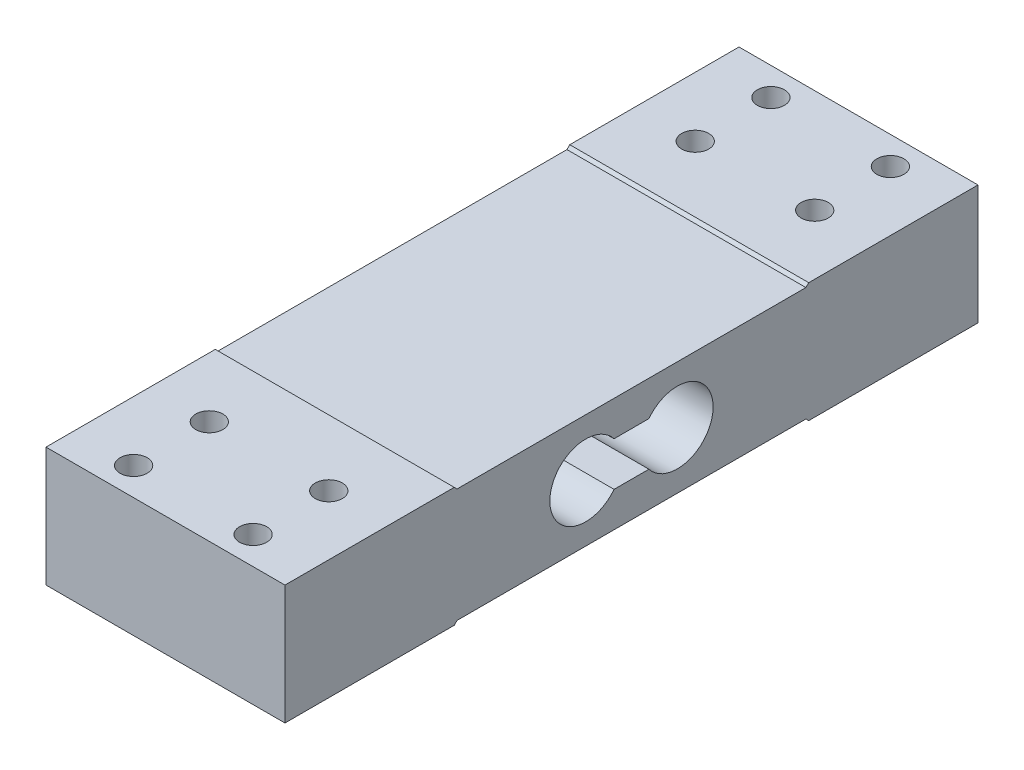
ISO-10303-21;
HEADER;
FILE_DESCRIPTION(('STEP AP214'),'2;1');
FILE_NAME('part.step','',(''),(''),'','','');
FILE_SCHEMA(('AUTOMOTIVE_DESIGN { 1 0 10303 214 1 1 1 1 }'));
ENDSEC;
DATA;
#1=APPLICATION_CONTEXT('core data for automotive mechanical design processes');
#2=APPLICATION_PROTOCOL_DEFINITION('international standard','automotive_design',2000,#1);
#3=PRODUCT_CONTEXT('',#1,'mechanical');
#4=PRODUCT('Part','Part','',(#3));
#5=PRODUCT_RELATED_PRODUCT_CATEGORY('part','',(#4));
#6=PRODUCT_DEFINITION_FORMATION('','',#4);
#7=PRODUCT_DEFINITION_CONTEXT('part definition',#1,'design');
#8=PRODUCT_DEFINITION('design','',#6,#7);
#9=PRODUCT_DEFINITION_SHAPE('','',#8);
#10=(LENGTH_UNIT() NAMED_UNIT(*) SI_UNIT(.MILLI.,.METRE.));
#11=(NAMED_UNIT(*) PLANE_ANGLE_UNIT() SI_UNIT($,.RADIAN.));
#12=(NAMED_UNIT(*) SI_UNIT($,.STERADIAN.) SOLID_ANGLE_UNIT());
#13=UNCERTAINTY_MEASURE_WITH_UNIT(LENGTH_MEASURE(1.E-05),#10,'distance_accuracy_value','');
#14=(GEOMETRIC_REPRESENTATION_CONTEXT(3) GLOBAL_UNCERTAINTY_ASSIGNED_CONTEXT((#13)) GLOBAL_UNIT_ASSIGNED_CONTEXT((#10,
#11,#12)) REPRESENTATION_CONTEXT('',''));
#15=CARTESIAN_POINT('',(0.,0.,0.));
#16=DIRECTION('',(0.,0.,1.));
#17=DIRECTION('',(1.,0.,0.));
#18=AXIS2_PLACEMENT_3D('',#15,#16,#17);
#19=CARTESIAN_POINT('',(30.,0.,0.));
#20=DIRECTION('',(0.,0.,-1.));
#21=DIRECTION('',(-1.,0.,0.));
#22=AXIS2_PLACEMENT_3D('',#19,#20,#21);
#23=PLANE('',#22);
#24=DIRECTION('',(0.,-1.,0.));
#25=VECTOR('',#24,1.);
#26=CARTESIAN_POINT('',(-30.,0.,0.));
#27=LINE('',#26,#25);
#28=CARTESIAN_POINT('',(-30.,30.,0.));
#29=VERTEX_POINT('',#28);
#30=CARTESIAN_POINT('',(-30.,0.,0.));
#31=VERTEX_POINT('',#30);
#32=EDGE_CURVE('E232',#29,#31,#27,.T.);
#33=ORIENTED_EDGE('',*,*,#32,.T.);
#34=DIRECTION('',(-1.,0.,0.));
#35=VECTOR('',#34,1.);
#36=CARTESIAN_POINT('',(30.,0.,0.));
#37=LINE('',#36,#35);
#38=CARTESIAN_POINT('',(30.,0.,0.));
#39=VERTEX_POINT('',#38);
#40=EDGE_CURVE('E11',#39,#31,#37,.T.);
#41=ORIENTED_EDGE('',*,*,#40,.F.);
#42=DIRECTION('',(0.,-1.,0.));
#43=VECTOR('',#42,1.);
#44=CARTESIAN_POINT('',(30.,0.,0.));
#45=LINE('',#44,#43);
#46=CARTESIAN_POINT('',(30.,30.,0.));
#47=VERTEX_POINT('',#46);
#48=EDGE_CURVE('E233',#47,#39,#45,.T.);
#49=ORIENTED_EDGE('',*,*,#48,.F.);
#50=DIRECTION('',(-1.,0.,0.));
#51=VECTOR('',#50,1.);
#52=CARTESIAN_POINT('',(30.,30.,0.));
#53=LINE('',#52,#51);
#54=EDGE_CURVE('E259',#47,#29,#53,.T.);
#55=ORIENTED_EDGE('',*,*,#54,.T.);
#56=EDGE_LOOP('',(#33,#41,#49,#55));
#57=FACE_BOUND('',#56,.T.);
#58=ADVANCED_FACE('F36',(#57),#23,.F.);
#59=CARTESIAN_POINT('',(30.,0.,0.));
#60=DIRECTION('',(0.,1.,0.));
#61=DIRECTION('',(0.,0.,1.));
#62=AXIS2_PLACEMENT_3D('',#59,#60,#61);
#63=PLANE('',#62);
#64=CARTESIAN_POINT('',(15.,0.,-26.));
#65=DIRECTION('',(0.,1.,0.));
#66=DIRECTION('',(0.,0.,1.));
#67=AXIS2_PLACEMENT_3D('',#64,#65,#66);
#68=CIRCLE('',#67,3.39999999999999);
#69=CARTESIAN_POINT('',(15.,0.,-22.6));
#70=VERTEX_POINT('',#69);
#71=EDGE_CURVE('E211',#70,#70,#68,.T.);
#72=ORIENTED_EDGE('',*,*,#71,.T.);
#73=EDGE_LOOP('',(#72));
#74=FACE_BOUND('',#73,.T.);
#75=CARTESIAN_POINT('',(15.,0.,-7.));
#76=DIRECTION('',(0.,1.,0.));
#77=DIRECTION('',(0.,0.,1.));
#78=AXIS2_PLACEMENT_3D('',#75,#76,#77);
#79=CIRCLE('',#78,3.39999999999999);
#80=CARTESIAN_POINT('',(15.,0.,-3.60000000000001));
#81=VERTEX_POINT('',#80);
#82=EDGE_CURVE('E217',#81,#81,#79,.T.);
#83=ORIENTED_EDGE('',*,*,#82,.T.);
#84=EDGE_LOOP('',(#83));
#85=FACE_BOUND('',#84,.T.);
#86=CARTESIAN_POINT('',(-15.,0.,-26.));
#87=DIRECTION('',(0.,1.,0.));
#88=DIRECTION('',(0.,0.,1.));
#89=AXIS2_PLACEMENT_3D('',#86,#87,#88);
#90=CIRCLE('',#89,3.39999999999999);
#91=CARTESIAN_POINT('',(-15.,0.,-22.6));
#92=VERTEX_POINT('',#91);
#93=EDGE_CURVE('E223',#92,#92,#90,.T.);
#94=ORIENTED_EDGE('',*,*,#93,.T.);
#95=EDGE_LOOP('',(#94));
#96=FACE_BOUND('',#95,.T.);
#97=CARTESIAN_POINT('',(-15.,0.,-7.));
#98=DIRECTION('',(0.,1.,0.));
#99=DIRECTION('',(0.,0.,1.));
#100=AXIS2_PLACEMENT_3D('',#97,#98,#99);
#101=CIRCLE('',#100,3.39999999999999);
#102=CARTESIAN_POINT('',(-15.,0.,-3.60000000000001));
#103=VERTEX_POINT('',#102);
#104=EDGE_CURVE('E229',#103,#103,#101,.T.);
#105=ORIENTED_EDGE('',*,*,#104,.T.);
#106=EDGE_LOOP('',(#105));
#107=FACE_BOUND('',#106,.T.);
#108=DIRECTION('',(0.,0.,-1.));
#109=VECTOR('',#108,1.);
#110=CARTESIAN_POINT('',(-30.,0.,0.));
#111=LINE('',#110,#109);
#112=CARTESIAN_POINT('',(-30.,0.,-42.5));
#113=VERTEX_POINT('',#112);
#114=EDGE_CURVE('E262',#31,#113,#111,.T.);
#115=ORIENTED_EDGE('',*,*,#114,.T.);
#116=DIRECTION('',(-1.,0.,0.));
#117=VECTOR('',#116,1.);
#118=CARTESIAN_POINT('',(30.,0.,-42.5));
#119=LINE('',#118,#117);
#120=CARTESIAN_POINT('',(30.,0.,-42.5));
#121=VERTEX_POINT('',#120);
#122=EDGE_CURVE('E43',#121,#113,#119,.T.);
#123=ORIENTED_EDGE('',*,*,#122,.F.);
#124=DIRECTION('',(0.,0.,-1.));
#125=VECTOR('',#124,1.);
#126=CARTESIAN_POINT('',(30.,0.,0.));
#127=LINE('',#126,#125);
#128=EDGE_CURVE('E236',#39,#121,#127,.T.);
#129=ORIENTED_EDGE('',*,*,#128,.F.);
#130=ORIENTED_EDGE('',*,*,#40,.T.);
#131=EDGE_LOOP('',(#115,#123,#129,#130));
#132=FACE_BOUND('',#131,.T.);
#133=ADVANCED_FACE('F337',(#74,#85,#96,#107,#132),#63,.F.);
#134=CARTESIAN_POINT('',(30.,0.,-42.5));
#135=DIRECTION('',(0.,0.707106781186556,0.707106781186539));
#136=DIRECTION('',(0.,-0.707106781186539,0.707106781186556));
#137=AXIS2_PLACEMENT_3D('',#134,#135,#136);
#138=PLANE('',#137);
#139=DIRECTION('',(0.,0.707106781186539,-0.707106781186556));
#140=VECTOR('',#139,1.);
#141=CARTESIAN_POINT('',(-30.,0.,-42.5));
#142=LINE('',#141,#140);
#143=CARTESIAN_POINT('',(-30.,0.707106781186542,-43.2071067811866));
#144=VERTEX_POINT('',#143);
#145=EDGE_CURVE('E264',#113,#144,#142,.T.);
#146=ORIENTED_EDGE('',*,*,#145,.T.);
#147=DIRECTION('',(-1.,0.,0.));
#148=VECTOR('',#147,1.);
#149=CARTESIAN_POINT('',(30.,0.707106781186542,-43.2071067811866));
#150=LINE('',#149,#148);
#151=CARTESIAN_POINT('',(30.,0.707106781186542,-43.2071067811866));
#152=VERTEX_POINT('',#151);
#153=EDGE_CURVE('E309',#152,#144,#150,.T.);
#154=ORIENTED_EDGE('',*,*,#153,.F.);
#155=DIRECTION('',(0.,0.707106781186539,-0.707106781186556));
#156=VECTOR('',#155,1.);
#157=CARTESIAN_POINT('',(30.,0.,-42.5));
#158=LINE('',#157,#156);
#159=EDGE_CURVE('E239',#121,#152,#158,.T.);
#160=ORIENTED_EDGE('',*,*,#159,.F.);
#161=ORIENTED_EDGE('',*,*,#122,.T.);
#162=EDGE_LOOP('',(#146,#154,#160,#161));
#163=FACE_BOUND('',#162,.T.);
#164=ADVANCED_FACE('F316',(#163),#138,.F.);
#165=CARTESIAN_POINT('',(30.,0.707106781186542,-43.2071067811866));
#166=DIRECTION('',(0.,1.,0.));
#167=DIRECTION('',(0.,0.,1.));
#168=AXIS2_PLACEMENT_3D('',#165,#166,#167);
#169=PLANE('',#168);
#170=DIRECTION('',(0.,0.,-1.));
#171=VECTOR('',#170,1.);
#172=CARTESIAN_POINT('',(-30.,0.707106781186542,-43.2071067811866));
#173=LINE('',#172,#171);
#174=CARTESIAN_POINT('',(-30.,0.707106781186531,-130.792893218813));
#175=VERTEX_POINT('',#174);
#176=EDGE_CURVE('E266',#144,#175,#173,.T.);
#177=ORIENTED_EDGE('',*,*,#176,.T.);
#178=DIRECTION('',(-1.,0.,0.));
#179=VECTOR('',#178,1.);
#180=CARTESIAN_POINT('',(30.,0.707106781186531,-130.792893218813));
#181=LINE('',#180,#179);
#182=CARTESIAN_POINT('',(30.,0.707106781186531,-130.792893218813));
#183=VERTEX_POINT('',#182);
#184=EDGE_CURVE('E306',#183,#175,#181,.T.);
#185=ORIENTED_EDGE('',*,*,#184,.F.);
#186=DIRECTION('',(0.,0.,-1.));
#187=VECTOR('',#186,1.);
#188=CARTESIAN_POINT('',(30.,0.707106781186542,-43.2071067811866));
#189=LINE('',#188,#187);
#190=EDGE_CURVE('E241',#152,#183,#189,.T.);
#191=ORIENTED_EDGE('',*,*,#190,.F.);
#192=ORIENTED_EDGE('',*,*,#153,.T.);
#193=EDGE_LOOP('',(#177,#185,#191,#192));
#194=FACE_BOUND('',#193,.T.);
#195=ADVANCED_FACE('F325',(#194),#169,.F.);
#196=CARTESIAN_POINT('',(30.,0.,-131.5));
#197=DIRECTION('',(0.,0.707106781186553,-0.707106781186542));
#198=DIRECTION('',(0.,0.707106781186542,0.707106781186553));
#199=AXIS2_PLACEMENT_3D('',#196,#197,#198);
#200=PLANE('',#199);
#201=DIRECTION('',(0.,-0.707106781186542,-0.707106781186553));
#202=VECTOR('',#201,1.);
#203=CARTESIAN_POINT('',(-30.,0.,-131.5));
#204=LINE('',#203,#202);
#205=CARTESIAN_POINT('',(-30.,0.,-131.5));
#206=VERTEX_POINT('',#205);
#207=EDGE_CURVE('E268',#175,#206,#204,.T.);
#208=ORIENTED_EDGE('',*,*,#207,.T.);
#209=DIRECTION('',(-1.,0.,0.));
#210=VECTOR('',#209,1.);
#211=CARTESIAN_POINT('',(30.,0.,-131.5));
#212=LINE('',#211,#210);
#213=CARTESIAN_POINT('',(30.,0.,-131.5));
#214=VERTEX_POINT('',#213);
#215=EDGE_CURVE('E303',#214,#206,#212,.T.);
#216=ORIENTED_EDGE('',*,*,#215,.F.);
#217=DIRECTION('',(0.,-0.707106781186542,-0.707106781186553));
#218=VECTOR('',#217,1.);
#219=CARTESIAN_POINT('',(30.,0.,-131.5));
#220=LINE('',#219,#218);
#221=EDGE_CURVE('E243',#183,#214,#220,.T.);
#222=ORIENTED_EDGE('',*,*,#221,.F.);
#223=ORIENTED_EDGE('',*,*,#184,.T.);
#224=EDGE_LOOP('',(#208,#216,#222,#223));
#225=FACE_BOUND('',#224,.T.);
#226=ADVANCED_FACE('F329',(#225),#200,.F.);
#227=CARTESIAN_POINT('',(30.,0.,-131.5));
#228=DIRECTION('',(0.,1.,0.));
#229=DIRECTION('',(0.,0.,1.));
#230=AXIS2_PLACEMENT_3D('',#227,#228,#229);
#231=PLANE('',#230);
#232=CARTESIAN_POINT('',(15.,0.,-148.));
#233=DIRECTION('',(0.,-1.,0.));
#234=DIRECTION('',(0.,0.,-1.));
#235=AXIS2_PLACEMENT_3D('',#232,#233,#234);
#236=CIRCLE('',#235,3.39999999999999);
#237=CARTESIAN_POINT('',(15.,0.,-151.4));
#238=VERTEX_POINT('',#237);
#239=EDGE_CURVE('E181',#238,#238,#236,.T.);
#240=ORIENTED_EDGE('',*,*,#239,.F.);
#241=EDGE_LOOP('',(#240));
#242=FACE_BOUND('',#241,.T.);
#243=CARTESIAN_POINT('',(15.,0.,-167.));
#244=DIRECTION('',(0.,-1.,0.));
#245=DIRECTION('',(0.,0.,-1.));
#246=AXIS2_PLACEMENT_3D('',#243,#244,#245);
#247=CIRCLE('',#246,3.39999999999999);
#248=CARTESIAN_POINT('',(15.,0.,-170.4));
#249=VERTEX_POINT('',#248);
#250=EDGE_CURVE('E190',#249,#249,#247,.T.);
#251=ORIENTED_EDGE('',*,*,#250,.F.);
#252=EDGE_LOOP('',(#251));
#253=FACE_BOUND('',#252,.T.);
#254=CARTESIAN_POINT('',(-15.,0.,-148.));
#255=DIRECTION('',(0.,-1.,0.));
#256=DIRECTION('',(0.,0.,-1.));
#257=AXIS2_PLACEMENT_3D('',#254,#255,#256);
#258=CIRCLE('',#257,3.39999999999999);
#259=CARTESIAN_POINT('',(-15.,0.,-151.4));
#260=VERTEX_POINT('',#259);
#261=EDGE_CURVE('E196',#260,#260,#258,.T.);
#262=ORIENTED_EDGE('',*,*,#261,.F.);
#263=EDGE_LOOP('',(#262));
#264=FACE_BOUND('',#263,.T.);
#265=CARTESIAN_POINT('',(-15.,0.,-167.));
#266=DIRECTION('',(0.,-1.,0.));
#267=DIRECTION('',(0.,0.,-1.));
#268=AXIS2_PLACEMENT_3D('',#265,#266,#267);
#269=CIRCLE('',#268,3.39999999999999);
#270=CARTESIAN_POINT('',(-15.,0.,-170.4));
#271=VERTEX_POINT('',#270);
#272=EDGE_CURVE('E202',#271,#271,#269,.T.);
#273=ORIENTED_EDGE('',*,*,#272,.F.);
#274=EDGE_LOOP('',(#273));
#275=FACE_BOUND('',#274,.T.);
#276=DIRECTION('',(0.,0.,-1.));
#277=VECTOR('',#276,1.);
#278=CARTESIAN_POINT('',(-30.,0.,-131.5));
#279=LINE('',#278,#277);
#280=CARTESIAN_POINT('',(-30.,0.,-174.));
#281=VERTEX_POINT('',#280);
#282=EDGE_CURVE('E270',#206,#281,#279,.T.);
#283=ORIENTED_EDGE('',*,*,#282,.T.);
#284=DIRECTION('',(-1.,0.,0.));
#285=VECTOR('',#284,1.);
#286=CARTESIAN_POINT('',(30.,0.,-174.));
#287=LINE('',#286,#285);
#288=CARTESIAN_POINT('',(30.,0.,-174.));
#289=VERTEX_POINT('',#288);
#290=EDGE_CURVE('E300',#289,#281,#287,.T.);
#291=ORIENTED_EDGE('',*,*,#290,.F.);
#292=DIRECTION('',(0.,0.,-1.));
#293=VECTOR('',#292,1.);
#294=CARTESIAN_POINT('',(30.,0.,-131.5));
#295=LINE('',#294,#293);
#296=EDGE_CURVE('E245',#214,#289,#295,.T.);
#297=ORIENTED_EDGE('',*,*,#296,.F.);
#298=ORIENTED_EDGE('',*,*,#215,.T.);
#299=EDGE_LOOP('',(#283,#291,#297,#298));
#300=FACE_BOUND('',#299,.T.);
#301=ADVANCED_FACE('F370',(#242,#253,#264,#275,#300),#231,.F.);
#302=CARTESIAN_POINT('',(30.,0.,-174.));
#303=DIRECTION('',(0.,0.,1.));
#304=DIRECTION('',(1.,0.,0.));
#305=AXIS2_PLACEMENT_3D('',#302,#303,#304);
#306=PLANE('',#305);
#307=DIRECTION('',(0.,1.,0.));
#308=VECTOR('',#307,1.);
#309=CARTESIAN_POINT('',(-30.,0.,-174.));
#310=LINE('',#309,#308);
#311=CARTESIAN_POINT('',(-30.,30.,-174.));
#312=VERTEX_POINT('',#311);
#313=EDGE_CURVE('E272',#281,#312,#310,.T.);
#314=ORIENTED_EDGE('',*,*,#313,.T.);
#315=DIRECTION('',(-1.,0.,0.));
#316=VECTOR('',#315,1.);
#317=CARTESIAN_POINT('',(30.,30.,-174.));
#318=LINE('',#317,#316);
#319=CARTESIAN_POINT('',(30.,30.,-174.));
#320=VERTEX_POINT('',#319);
#321=EDGE_CURVE('E297',#320,#312,#318,.T.);
#322=ORIENTED_EDGE('',*,*,#321,.F.);
#323=DIRECTION('',(0.,1.,0.));
#324=VECTOR('',#323,1.);
#325=CARTESIAN_POINT('',(30.,0.,-174.));
#326=LINE('',#325,#324);
#327=EDGE_CURVE('E247',#289,#320,#326,.T.);
#328=ORIENTED_EDGE('',*,*,#327,.F.);
#329=ORIENTED_EDGE('',*,*,#290,.T.);
#330=EDGE_LOOP('',(#314,#322,#328,#329));
#331=FACE_BOUND('',#330,.T.);
#332=ADVANCED_FACE('F368',(#331),#306,.F.);
#333=CARTESIAN_POINT('',(30.,30.,-131.5));
#334=DIRECTION('',(0.,-1.,0.));
#335=DIRECTION('',(0.,0.,-1.));
#336=AXIS2_PLACEMENT_3D('',#333,#334,#335);
#337=PLANE('',#336);
#338=CARTESIAN_POINT('',(15.,30.,-148.));
#339=DIRECTION('',(0.,-1.,0.));
#340=DIRECTION('',(0.,0.,-1.));
#341=AXIS2_PLACEMENT_3D('',#338,#339,#340);
#342=CIRCLE('',#341,3.39999999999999);
#343=CARTESIAN_POINT('',(15.,30.,-151.4));
#344=VERTEX_POINT('',#343);
#345=EDGE_CURVE('E187',#344,#344,#342,.T.);
#346=ORIENTED_EDGE('',*,*,#345,.T.);
#347=EDGE_LOOP('',(#346));
#348=FACE_BOUND('',#347,.T.);
#349=CARTESIAN_POINT('',(15.,30.,-167.));
#350=DIRECTION('',(0.,-1.,0.));
#351=DIRECTION('',(0.,0.,-1.));
#352=AXIS2_PLACEMENT_3D('',#349,#350,#351);
#353=CIRCLE('',#352,3.39999999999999);
#354=CARTESIAN_POINT('',(15.,30.,-170.4));
#355=VERTEX_POINT('',#354);
#356=EDGE_CURVE('E193',#355,#355,#353,.T.);
#357=ORIENTED_EDGE('',*,*,#356,.T.);
#358=EDGE_LOOP('',(#357));
#359=FACE_BOUND('',#358,.T.);
#360=CARTESIAN_POINT('',(-15.,30.,-148.));
#361=DIRECTION('',(0.,-1.,0.));
#362=DIRECTION('',(0.,0.,-1.));
#363=AXIS2_PLACEMENT_3D('',#360,#361,#362);
#364=CIRCLE('',#363,3.39999999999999);
#365=CARTESIAN_POINT('',(-15.,30.,-151.4));
#366=VERTEX_POINT('',#365);
#367=EDGE_CURVE('E199',#366,#366,#364,.T.);
#368=ORIENTED_EDGE('',*,*,#367,.T.);
#369=EDGE_LOOP('',(#368));
#370=FACE_BOUND('',#369,.T.);
#371=CARTESIAN_POINT('',(-15.,30.,-167.));
#372=DIRECTION('',(0.,-1.,0.));
#373=DIRECTION('',(0.,0.,-1.));
#374=AXIS2_PLACEMENT_3D('',#371,#372,#373);
#375=CIRCLE('',#374,3.39999999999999);
#376=CARTESIAN_POINT('',(-15.,30.,-170.4));
#377=VERTEX_POINT('',#376);
#378=EDGE_CURVE('E205',#377,#377,#375,.T.);
#379=ORIENTED_EDGE('',*,*,#378,.T.);
#380=EDGE_LOOP('',(#379));
#381=FACE_BOUND('',#380,.T.);
#382=DIRECTION('',(0.,0.,1.));
#383=VECTOR('',#382,1.);
#384=CARTESIAN_POINT('',(-30.,30.,-131.5));
#385=LINE('',#384,#383);
#386=CARTESIAN_POINT('',(-30.,30.,-131.5));
#387=VERTEX_POINT('',#386);
#388=EDGE_CURVE('E274',#312,#387,#385,.T.);
#389=ORIENTED_EDGE('',*,*,#388,.T.);
#390=DIRECTION('',(-1.,0.,0.));
#391=VECTOR('',#390,1.);
#392=CARTESIAN_POINT('',(30.,30.,-131.5));
#393=LINE('',#392,#391);
#394=CARTESIAN_POINT('',(30.,30.,-131.5));
#395=VERTEX_POINT('',#394);
#396=EDGE_CURVE('E294',#395,#387,#393,.T.);
#397=ORIENTED_EDGE('',*,*,#396,.F.);
#398=DIRECTION('',(0.,0.,1.));
#399=VECTOR('',#398,1.);
#400=CARTESIAN_POINT('',(30.,30.,-131.5));
#401=LINE('',#400,#399);
#402=EDGE_CURVE('E249',#320,#395,#401,.T.);
#403=ORIENTED_EDGE('',*,*,#402,.F.);
#404=ORIENTED_EDGE('',*,*,#321,.T.);
#405=EDGE_LOOP('',(#389,#397,#403,#404));
#406=FACE_BOUND('',#405,.T.);
#407=ADVANCED_FACE('F364',(#348,#359,#370,#381,#406),#337,.F.);
#408=CARTESIAN_POINT('',(30.,30.,-131.5));
#409=DIRECTION('',(0.,-0.707106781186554,-0.707106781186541));
#410=DIRECTION('',(0.,0.707106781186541,-0.707106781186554));
#411=AXIS2_PLACEMENT_3D('',#408,#409,#410);
#412=PLANE('',#411);
#413=DIRECTION('',(0.,-0.707106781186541,0.707106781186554));
#414=VECTOR('',#413,1.);
#415=CARTESIAN_POINT('',(-30.,30.,-131.5));
#416=LINE('',#415,#414);
#417=CARTESIAN_POINT('',(-30.,29.2928932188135,-130.792893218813));
#418=VERTEX_POINT('',#417);
#419=EDGE_CURVE('E276',#387,#418,#416,.T.);
#420=ORIENTED_EDGE('',*,*,#419,.T.);
#421=DIRECTION('',(-1.,0.,0.));
#422=VECTOR('',#421,1.);
#423=CARTESIAN_POINT('',(30.,29.2928932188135,-130.792893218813));
#424=LINE('',#423,#422);
#425=CARTESIAN_POINT('',(30.,29.2928932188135,-130.792893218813));
#426=VERTEX_POINT('',#425);
#427=EDGE_CURVE('E291',#426,#418,#424,.T.);
#428=ORIENTED_EDGE('',*,*,#427,.F.);
#429=DIRECTION('',(0.,-0.707106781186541,0.707106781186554));
#430=VECTOR('',#429,1.);
#431=CARTESIAN_POINT('',(30.,30.,-131.5));
#432=LINE('',#431,#430);
#433=EDGE_CURVE('E251',#395,#426,#432,.T.);
#434=ORIENTED_EDGE('',*,*,#433,.F.);
#435=ORIENTED_EDGE('',*,*,#396,.T.);
#436=EDGE_LOOP('',(#420,#428,#434,#435));
#437=FACE_BOUND('',#436,.T.);
#438=ADVANCED_FACE('F359',(#437),#412,.F.);
#439=CARTESIAN_POINT('',(30.,29.2928932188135,-43.2071067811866));
#440=DIRECTION('',(0.,-1.,0.));
#441=DIRECTION('',(0.,0.,-1.));
#442=AXIS2_PLACEMENT_3D('',#439,#440,#441);
#443=PLANE('',#442);
#444=DIRECTION('',(0.,0.,1.));
#445=VECTOR('',#444,1.);
#446=CARTESIAN_POINT('',(-30.,29.2928932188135,-43.2071067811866));
#447=LINE('',#446,#445);
#448=CARTESIAN_POINT('',(-30.,29.2928932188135,-43.2071067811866));
#449=VERTEX_POINT('',#448);
#450=EDGE_CURVE('E278',#418,#449,#447,.T.);
#451=ORIENTED_EDGE('',*,*,#450,.T.);
#452=DIRECTION('',(-1.,0.,0.));
#453=VECTOR('',#452,1.);
#454=CARTESIAN_POINT('',(30.,29.2928932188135,-43.2071067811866));
#455=LINE('',#454,#453);
#456=CARTESIAN_POINT('',(30.,29.2928932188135,-43.2071067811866));
#457=VERTEX_POINT('',#456);
#458=EDGE_CURVE('E288',#457,#449,#455,.T.);
#459=ORIENTED_EDGE('',*,*,#458,.F.);
#460=DIRECTION('',(0.,0.,1.));
#461=VECTOR('',#460,1.);
#462=CARTESIAN_POINT('',(30.,29.2928932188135,-43.2071067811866));
#463=LINE('',#462,#461);
#464=EDGE_CURVE('E253',#426,#457,#463,.T.);
#465=ORIENTED_EDGE('',*,*,#464,.F.);
#466=ORIENTED_EDGE('',*,*,#427,.T.);
#467=EDGE_LOOP('',(#451,#459,#465,#466));
#468=FACE_BOUND('',#467,.T.);
#469=ADVANCED_FACE('F353',(#468),#443,.F.);
#470=CARTESIAN_POINT('',(30.,30.,-42.5));
#471=DIRECTION('',(0.,-0.707106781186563,0.707106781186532));
#472=DIRECTION('',(0.,-0.707106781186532,-0.707106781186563));
#473=AXIS2_PLACEMENT_3D('',#470,#471,#472);
#474=PLANE('',#473);
#475=DIRECTION('',(0.,0.707106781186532,0.707106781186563));
#476=VECTOR('',#475,1.);
#477=CARTESIAN_POINT('',(-30.,30.,-42.5));
#478=LINE('',#477,#476);
#479=CARTESIAN_POINT('',(-30.,30.,-42.5));
#480=VERTEX_POINT('',#479);
#481=EDGE_CURVE('E280',#449,#480,#478,.T.);
#482=ORIENTED_EDGE('',*,*,#481,.T.);
#483=DIRECTION('',(-1.,0.,0.));
#484=VECTOR('',#483,1.);
#485=CARTESIAN_POINT('',(30.,30.,-42.5));
#486=LINE('',#485,#484);
#487=CARTESIAN_POINT('',(30.,30.,-42.5));
#488=VERTEX_POINT('',#487);
#489=EDGE_CURVE('E285',#488,#480,#486,.T.);
#490=ORIENTED_EDGE('',*,*,#489,.F.);
#491=DIRECTION('',(0.,0.707106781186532,0.707106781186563));
#492=VECTOR('',#491,1.);
#493=CARTESIAN_POINT('',(30.,30.,-42.5));
#494=LINE('',#493,#492);
#495=EDGE_CURVE('E255',#457,#488,#494,.T.);
#496=ORIENTED_EDGE('',*,*,#495,.F.);
#497=ORIENTED_EDGE('',*,*,#458,.T.);
#498=EDGE_LOOP('',(#482,#490,#496,#497));
#499=FACE_BOUND('',#498,.T.);
#500=ADVANCED_FACE('F349',(#499),#474,.F.);
#501=CARTESIAN_POINT('',(30.,30.,0.));
#502=DIRECTION('',(0.,-1.,0.));
#503=DIRECTION('',(0.,0.,-1.));
#504=AXIS2_PLACEMENT_3D('',#501,#502,#503);
#505=PLANE('',#504);
#506=CARTESIAN_POINT('',(15.,30.,-26.));
#507=DIRECTION('',(0.,1.,0.));
#508=DIRECTION('',(0.,0.,1.));
#509=AXIS2_PLACEMENT_3D('',#506,#507,#508);
#510=CIRCLE('',#509,3.39999999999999);
#511=CARTESIAN_POINT('',(15.,30.,-22.6));
#512=VERTEX_POINT('',#511);
#513=EDGE_CURVE('E208',#512,#512,#510,.T.);
#514=ORIENTED_EDGE('',*,*,#513,.F.);
#515=EDGE_LOOP('',(#514));
#516=FACE_BOUND('',#515,.T.);
#517=CARTESIAN_POINT('',(15.,30.,-7.));
#518=DIRECTION('',(0.,1.,0.));
#519=DIRECTION('',(0.,0.,1.));
#520=AXIS2_PLACEMENT_3D('',#517,#518,#519);
#521=CIRCLE('',#520,3.39999999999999);
#522=CARTESIAN_POINT('',(15.,30.,-3.60000000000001));
#523=VERTEX_POINT('',#522);
#524=EDGE_CURVE('E214',#523,#523,#521,.T.);
#525=ORIENTED_EDGE('',*,*,#524,.F.);
#526=EDGE_LOOP('',(#525));
#527=FACE_BOUND('',#526,.T.);
#528=CARTESIAN_POINT('',(-15.,30.,-26.));
#529=DIRECTION('',(0.,1.,0.));
#530=DIRECTION('',(0.,0.,1.));
#531=AXIS2_PLACEMENT_3D('',#528,#529,#530);
#532=CIRCLE('',#531,3.39999999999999);
#533=CARTESIAN_POINT('',(-15.,30.,-22.6));
#534=VERTEX_POINT('',#533);
#535=EDGE_CURVE('E220',#534,#534,#532,.T.);
#536=ORIENTED_EDGE('',*,*,#535,.F.);
#537=EDGE_LOOP('',(#536));
#538=FACE_BOUND('',#537,.T.);
#539=CARTESIAN_POINT('',(-15.,30.,-7.));
#540=DIRECTION('',(0.,1.,0.));
#541=DIRECTION('',(0.,0.,1.));
#542=AXIS2_PLACEMENT_3D('',#539,#540,#541);
#543=CIRCLE('',#542,3.39999999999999);
#544=CARTESIAN_POINT('',(-15.,30.,-3.60000000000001));
#545=VERTEX_POINT('',#544);
#546=EDGE_CURVE('E226',#545,#545,#543,.T.);
#547=ORIENTED_EDGE('',*,*,#546,.F.);
#548=EDGE_LOOP('',(#547));
#549=FACE_BOUND('',#548,.T.);
#550=DIRECTION('',(0.,0.,1.));
#551=VECTOR('',#550,1.);
#552=CARTESIAN_POINT('',(-30.,30.,0.));
#553=LINE('',#552,#551);
#554=EDGE_CURVE('E237',#480,#29,#553,.T.);
#555=ORIENTED_EDGE('',*,*,#554,.T.);
#556=ORIENTED_EDGE('',*,*,#54,.F.);
#557=DIRECTION('',(0.,0.,1.));
#558=VECTOR('',#557,1.);
#559=CARTESIAN_POINT('',(30.,30.,0.));
#560=LINE('',#559,#558);
#561=EDGE_CURVE('E257',#488,#47,#560,.T.);
#562=ORIENTED_EDGE('',*,*,#561,.F.);
#563=ORIENTED_EDGE('',*,*,#489,.T.);
#564=EDGE_LOOP('',(#555,#556,#562,#563));
#565=FACE_BOUND('',#564,.T.);
#566=ADVANCED_FACE('F344',(#516,#527,#538,#549,#565),#505,.F.);
#567=CARTESIAN_POINT('',(30.,30.,0.));
#568=DIRECTION('',(-1.,0.,0.));
#569=DIRECTION('',(0.,0.,1.));
#570=AXIS2_PLACEMENT_3D('',#567,#568,#569);
#571=PLANE('',#570);
#572=DIRECTION('',(0.,0.,-1.));
#573=VECTOR('',#572,1.);
#574=CARTESIAN_POINT('',(30.,9.5,-82.6239034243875));
#575=LINE('',#574,#573);
#576=CARTESIAN_POINT('',(30.,9.5,-82.6239034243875));
#577=VERTEX_POINT('',#576);
#578=CARTESIAN_POINT('',(30.,9.5,-91.3760965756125));
#579=VERTEX_POINT('',#578);
#580=EDGE_CURVE('E175',#577,#579,#575,.T.);
#581=ORIENTED_EDGE('',*,*,#580,.F.);
#582=CARTESIAN_POINT('',(30.,15.,-75.5));
#583=DIRECTION('',(1.,0.,0.));
#584=DIRECTION('',(0.,0.,-1.));
#585=AXIS2_PLACEMENT_3D('',#582,#583,#584);
#586=CIRCLE('',#585,8.99999999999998);
#587=CARTESIAN_POINT('',(30.,20.5,-82.6239034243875));
#588=VERTEX_POINT('',#587);
#589=EDGE_CURVE('E50',#588,#577,#586,.T.);
#590=ORIENTED_EDGE('',*,*,#589,.F.);
#591=DIRECTION('',(0.,0.,1.));
#592=VECTOR('',#591,1.);
#593=CARTESIAN_POINT('',(30.,20.5,-82.6239034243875));
#594=LINE('',#593,#592);
#595=CARTESIAN_POINT('',(30.,20.5,-91.3760965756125));
#596=VERTEX_POINT('',#595);
#597=EDGE_CURVE('E166',#596,#588,#594,.T.);
#598=ORIENTED_EDGE('',*,*,#597,.F.);
#599=CARTESIAN_POINT('',(30.,15.,-98.5));
#600=DIRECTION('',(1.,0.,0.));
#601=DIRECTION('',(0.,0.,1.));
#602=AXIS2_PLACEMENT_3D('',#599,#600,#601);
#603=CIRCLE('',#602,9.00000000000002);
#604=EDGE_CURVE('E169',#579,#596,#603,.T.);
#605=ORIENTED_EDGE('',*,*,#604,.F.);
#606=EDGE_LOOP('',(#581,#590,#598,#605));
#607=FACE_BOUND('',#606,.T.);
#608=ORIENTED_EDGE('',*,*,#48,.T.);
#609=ORIENTED_EDGE('',*,*,#128,.T.);
#610=ORIENTED_EDGE('',*,*,#159,.T.);
#611=ORIENTED_EDGE('',*,*,#190,.T.);
#612=ORIENTED_EDGE('',*,*,#221,.T.);
#613=ORIENTED_EDGE('',*,*,#296,.T.);
#614=ORIENTED_EDGE('',*,*,#327,.T.);
#615=ORIENTED_EDGE('',*,*,#402,.T.);
#616=ORIENTED_EDGE('',*,*,#433,.T.);
#617=ORIENTED_EDGE('',*,*,#464,.T.);
#618=ORIENTED_EDGE('',*,*,#495,.T.);
#619=ORIENTED_EDGE('',*,*,#561,.T.);
#620=EDGE_LOOP('',(#608,#609,#610,#611,#612,#613,#614,#615,#616,#617,#618,#619));
#621=FACE_BOUND('',#620,.T.);
#622=ADVANCED_FACE('F333',(#607,#621),#571,.F.);
#623=CARTESIAN_POINT('',(-30.,30.,0.));
#624=DIRECTION('',(-1.,0.,0.));
#625=DIRECTION('',(0.,0.,1.));
#626=AXIS2_PLACEMENT_3D('',#623,#624,#625);
#627=PLANE('',#626);
#628=CARTESIAN_POINT('',(-30.,15.,-75.5));
#629=DIRECTION('',(1.,0.,0.));
#630=DIRECTION('',(0.,0.,-1.));
#631=AXIS2_PLACEMENT_3D('',#628,#629,#630);
#632=CIRCLE('',#631,8.99999999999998);
#633=CARTESIAN_POINT('',(-30.,20.5,-82.6239034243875));
#634=VERTEX_POINT('',#633);
#635=CARTESIAN_POINT('',(-30.,9.5,-82.6239034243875));
#636=VERTEX_POINT('',#635);
#637=EDGE_CURVE('E150',#634,#636,#632,.T.);
#638=ORIENTED_EDGE('',*,*,#637,.T.);
#639=DIRECTION('',(0.,0.,-1.));
#640=VECTOR('',#639,1.);
#641=CARTESIAN_POINT('',(-30.,9.5,-82.6239034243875));
#642=LINE('',#641,#640);
#643=CARTESIAN_POINT('',(-30.,9.5,-91.3760965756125));
#644=VERTEX_POINT('',#643);
#645=EDGE_CURVE('E159',#636,#644,#642,.T.);
#646=ORIENTED_EDGE('',*,*,#645,.T.);
#647=CARTESIAN_POINT('',(-30.,15.,-98.5));
#648=DIRECTION('',(1.,0.,0.));
#649=DIRECTION('',(0.,0.,1.));
#650=AXIS2_PLACEMENT_3D('',#647,#648,#649);
#651=CIRCLE('',#650,9.00000000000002);
#652=CARTESIAN_POINT('',(-30.,20.5,-91.3760965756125));
#653=VERTEX_POINT('',#652);
#654=EDGE_CURVE('E58',#644,#653,#651,.T.);
#655=ORIENTED_EDGE('',*,*,#654,.T.);
#656=DIRECTION('',(0.,0.,1.));
#657=VECTOR('',#656,1.);
#658=CARTESIAN_POINT('',(-30.,20.5,-82.6239034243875));
#659=LINE('',#658,#657);
#660=EDGE_CURVE('E156',#653,#634,#659,.T.);
#661=ORIENTED_EDGE('',*,*,#660,.T.);
#662=EDGE_LOOP('',(#638,#646,#655,#661));
#663=FACE_BOUND('',#662,.T.);
#664=ORIENTED_EDGE('',*,*,#32,.F.);
#665=ORIENTED_EDGE('',*,*,#554,.F.);
#666=ORIENTED_EDGE('',*,*,#481,.F.);
#667=ORIENTED_EDGE('',*,*,#450,.F.);
#668=ORIENTED_EDGE('',*,*,#419,.F.);
#669=ORIENTED_EDGE('',*,*,#388,.F.);
#670=ORIENTED_EDGE('',*,*,#313,.F.);
#671=ORIENTED_EDGE('',*,*,#282,.F.);
#672=ORIENTED_EDGE('',*,*,#207,.F.);
#673=ORIENTED_EDGE('',*,*,#176,.F.);
#674=ORIENTED_EDGE('',*,*,#145,.F.);
#675=ORIENTED_EDGE('',*,*,#114,.F.);
#676=EDGE_LOOP('',(#664,#665,#666,#667,#668,#669,#670,#671,#672,#673,#674,#675));
#677=FACE_BOUND('',#676,.T.);
#678=ADVANCED_FACE('F163',(#663,#677),#627,.T.);
#679=CARTESIAN_POINT('',(-15.,30.,-7.));
#680=DIRECTION('',(0.,1.,0.));
#681=DIRECTION('',(0.,0.,1.));
#682=AXIS2_PLACEMENT_3D('',#679,#680,#681);
#683=CYLINDRICAL_SURFACE('',#682,3.39999999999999);
#684=ORIENTED_EDGE('',*,*,#104,.F.);
#685=EDGE_LOOP('',(#684));
#686=FACE_BOUND('',#685,.T.);
#687=ORIENTED_EDGE('',*,*,#546,.T.);
#688=EDGE_LOOP('',(#687));
#689=FACE_BOUND('',#688,.T.);
#690=ADVANCED_FACE('F442',(#686,#689),#683,.F.);
#691=CARTESIAN_POINT('',(-15.,30.,-26.));
#692=DIRECTION('',(0.,1.,0.));
#693=DIRECTION('',(0.,0.,1.));
#694=AXIS2_PLACEMENT_3D('',#691,#692,#693);
#695=CYLINDRICAL_SURFACE('',#694,3.39999999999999);
#696=ORIENTED_EDGE('',*,*,#93,.F.);
#697=EDGE_LOOP('',(#696));
#698=FACE_BOUND('',#697,.T.);
#699=ORIENTED_EDGE('',*,*,#535,.T.);
#700=EDGE_LOOP('',(#699));
#701=FACE_BOUND('',#700,.T.);
#702=ADVANCED_FACE('F447',(#698,#701),#695,.F.);
#703=CARTESIAN_POINT('',(15.,30.,-7.));
#704=DIRECTION('',(0.,1.,0.));
#705=DIRECTION('',(0.,0.,1.));
#706=AXIS2_PLACEMENT_3D('',#703,#704,#705);
#707=CYLINDRICAL_SURFACE('',#706,3.39999999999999);
#708=ORIENTED_EDGE('',*,*,#82,.F.);
#709=EDGE_LOOP('',(#708));
#710=FACE_BOUND('',#709,.T.);
#711=ORIENTED_EDGE('',*,*,#524,.T.);
#712=EDGE_LOOP('',(#711));
#713=FACE_BOUND('',#712,.T.);
#714=ADVANCED_FACE('F475',(#710,#713),#707,.F.);
#715=CARTESIAN_POINT('',(15.,30.,-26.));
#716=DIRECTION('',(0.,1.,0.));
#717=DIRECTION('',(0.,0.,1.));
#718=AXIS2_PLACEMENT_3D('',#715,#716,#717);
#719=CYLINDRICAL_SURFACE('',#718,3.39999999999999);
#720=ORIENTED_EDGE('',*,*,#71,.F.);
#721=EDGE_LOOP('',(#720));
#722=FACE_BOUND('',#721,.T.);
#723=ORIENTED_EDGE('',*,*,#513,.T.);
#724=EDGE_LOOP('',(#723));
#725=FACE_BOUND('',#724,.T.);
#726=ADVANCED_FACE('F486',(#722,#725),#719,.F.);
#727=CARTESIAN_POINT('',(-15.,0.,-167.));
#728=DIRECTION('',(0.,-1.,0.));
#729=DIRECTION('',(0.,0.,-1.));
#730=AXIS2_PLACEMENT_3D('',#727,#728,#729);
#731=CYLINDRICAL_SURFACE('',#730,3.39999999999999);
#732=ORIENTED_EDGE('',*,*,#378,.F.);
#733=EDGE_LOOP('',(#732));
#734=FACE_BOUND('',#733,.T.);
#735=ORIENTED_EDGE('',*,*,#272,.T.);
#736=EDGE_LOOP('',(#735));
#737=FACE_BOUND('',#736,.T.);
#738=ADVANCED_FACE('F497',(#734,#737),#731,.F.);
#739=CARTESIAN_POINT('',(-15.,0.,-148.));
#740=DIRECTION('',(0.,-1.,0.));
#741=DIRECTION('',(0.,0.,-1.));
#742=AXIS2_PLACEMENT_3D('',#739,#740,#741);
#743=CYLINDRICAL_SURFACE('',#742,3.39999999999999);
#744=ORIENTED_EDGE('',*,*,#367,.F.);
#745=EDGE_LOOP('',(#744));
#746=FACE_BOUND('',#745,.T.);
#747=ORIENTED_EDGE('',*,*,#261,.T.);
#748=EDGE_LOOP('',(#747));
#749=FACE_BOUND('',#748,.T.);
#750=ADVANCED_FACE('F507',(#746,#749),#743,.F.);
#751=CARTESIAN_POINT('',(15.,0.,-167.));
#752=DIRECTION('',(0.,-1.,0.));
#753=DIRECTION('',(0.,0.,-1.));
#754=AXIS2_PLACEMENT_3D('',#751,#752,#753);
#755=CYLINDRICAL_SURFACE('',#754,3.39999999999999);
#756=ORIENTED_EDGE('',*,*,#356,.F.);
#757=EDGE_LOOP('',(#756));
#758=FACE_BOUND('',#757,.T.);
#759=ORIENTED_EDGE('',*,*,#250,.T.);
#760=EDGE_LOOP('',(#759));
#761=FACE_BOUND('',#760,.T.);
#762=ADVANCED_FACE('F529',(#758,#761),#755,.F.);
#763=CARTESIAN_POINT('',(15.,0.,-148.));
#764=DIRECTION('',(0.,-1.,0.));
#765=DIRECTION('',(0.,0.,-1.));
#766=AXIS2_PLACEMENT_3D('',#763,#764,#765);
#767=CYLINDRICAL_SURFACE('',#766,3.39999999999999);
#768=ORIENTED_EDGE('',*,*,#345,.F.);
#769=EDGE_LOOP('',(#768));
#770=FACE_BOUND('',#769,.T.);
#771=ORIENTED_EDGE('',*,*,#239,.T.);
#772=EDGE_LOOP('',(#771));
#773=FACE_BOUND('',#772,.T.);
#774=ADVANCED_FACE('F540',(#770,#773),#767,.F.);
#775=CARTESIAN_POINT('',(-30.,15.,-75.5));
#776=DIRECTION('',(1.,0.,0.));
#777=DIRECTION('',(0.,0.,-1.));
#778=AXIS2_PLACEMENT_3D('',#775,#776,#777);
#779=CYLINDRICAL_SURFACE('',#778,8.99999999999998);
#780=ORIENTED_EDGE('',*,*,#589,.T.);
#781=DIRECTION('',(1.,0.,0.));
#782=VECTOR('',#781,1.);
#783=CARTESIAN_POINT('',(-30.,9.5,-82.6239034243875));
#784=LINE('',#783,#782);
#785=EDGE_CURVE('E146',#636,#577,#784,.T.);
#786=ORIENTED_EDGE('',*,*,#785,.F.);
#787=ORIENTED_EDGE('',*,*,#637,.F.);
#788=DIRECTION('',(1.,0.,0.));
#789=VECTOR('',#788,1.);
#790=CARTESIAN_POINT('',(-30.,20.5,-82.6239034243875));
#791=LINE('',#790,#789);
#792=EDGE_CURVE('E179',#634,#588,#791,.T.);
#793=ORIENTED_EDGE('',*,*,#792,.T.);
#794=EDGE_LOOP('',(#780,#786,#787,#793));
#795=FACE_BOUND('',#794,.T.);
#796=ADVANCED_FACE('F148',(#795),#779,.F.);
#797=CARTESIAN_POINT('',(-30.,20.5,-82.6239034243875));
#798=DIRECTION('',(0.,1.,0.));
#799=DIRECTION('',(0.,0.,1.));
#800=AXIS2_PLACEMENT_3D('',#797,#798,#799);
#801=PLANE('',#800);
#802=ORIENTED_EDGE('',*,*,#597,.T.);
#803=ORIENTED_EDGE('',*,*,#792,.F.);
#804=ORIENTED_EDGE('',*,*,#660,.F.);
#805=DIRECTION('',(1.,0.,0.));
#806=VECTOR('',#805,1.);
#807=CARTESIAN_POINT('',(-30.,20.5,-91.3760965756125));
#808=LINE('',#807,#806);
#809=EDGE_CURVE('E182',#653,#596,#808,.T.);
#810=ORIENTED_EDGE('',*,*,#809,.T.);
#811=EDGE_LOOP('',(#802,#803,#804,#810));
#812=FACE_BOUND('',#811,.T.);
#813=ADVANCED_FACE('F574',(#812),#801,.F.);
#814=CARTESIAN_POINT('',(-30.,15.,-98.5));
#815=DIRECTION('',(1.,0.,0.));
#816=DIRECTION('',(0.,0.,-1.));
#817=AXIS2_PLACEMENT_3D('',#814,#815,#816);
#818=CYLINDRICAL_SURFACE('',#817,9.00000000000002);
#819=ORIENTED_EDGE('',*,*,#604,.T.);
#820=ORIENTED_EDGE('',*,*,#809,.F.);
#821=ORIENTED_EDGE('',*,*,#654,.F.);
#822=DIRECTION('',(1.,0.,0.));
#823=VECTOR('',#822,1.);
#824=CARTESIAN_POINT('',(-30.,9.5,-91.3760965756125));
#825=LINE('',#824,#823);
#826=EDGE_CURVE('E155',#644,#579,#825,.T.);
#827=ORIENTED_EDGE('',*,*,#826,.T.);
#828=EDGE_LOOP('',(#819,#820,#821,#827));
#829=FACE_BOUND('',#828,.T.);
#830=ADVANCED_FACE('F583',(#829),#818,.F.);
#831=CARTESIAN_POINT('',(-30.,9.5,-82.6239034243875));
#832=DIRECTION('',(0.,-1.,0.));
#833=DIRECTION('',(0.,0.,-1.));
#834=AXIS2_PLACEMENT_3D('',#831,#832,#833);
#835=PLANE('',#834);
#836=ORIENTED_EDGE('',*,*,#580,.T.);
#837=ORIENTED_EDGE('',*,*,#826,.F.);
#838=ORIENTED_EDGE('',*,*,#645,.F.);
#839=ORIENTED_EDGE('',*,*,#785,.T.);
#840=EDGE_LOOP('',(#836,#837,#838,#839));
#841=FACE_BOUND('',#840,.T.);
#842=ADVANCED_FACE('F160',(#841),#835,.F.);
#843=CLOSED_SHELL('',(#58,#133,#164,#195,#226,#301,#332,#407,#438,#469,#500,#566,#622,#678,#690,
#702,#714,#726,#738,#750,#762,#774,#796,#813,#830,#842));
#844=MANIFOLD_SOLID_BREP('B2',#843);
#845=ADVANCED_BREP_SHAPE_REPRESENTATION('',(#18,#844),#14);
#846=SHAPE_DEFINITION_REPRESENTATION(#9,#845);
ENDSEC;
END-ISO-10303-21;
